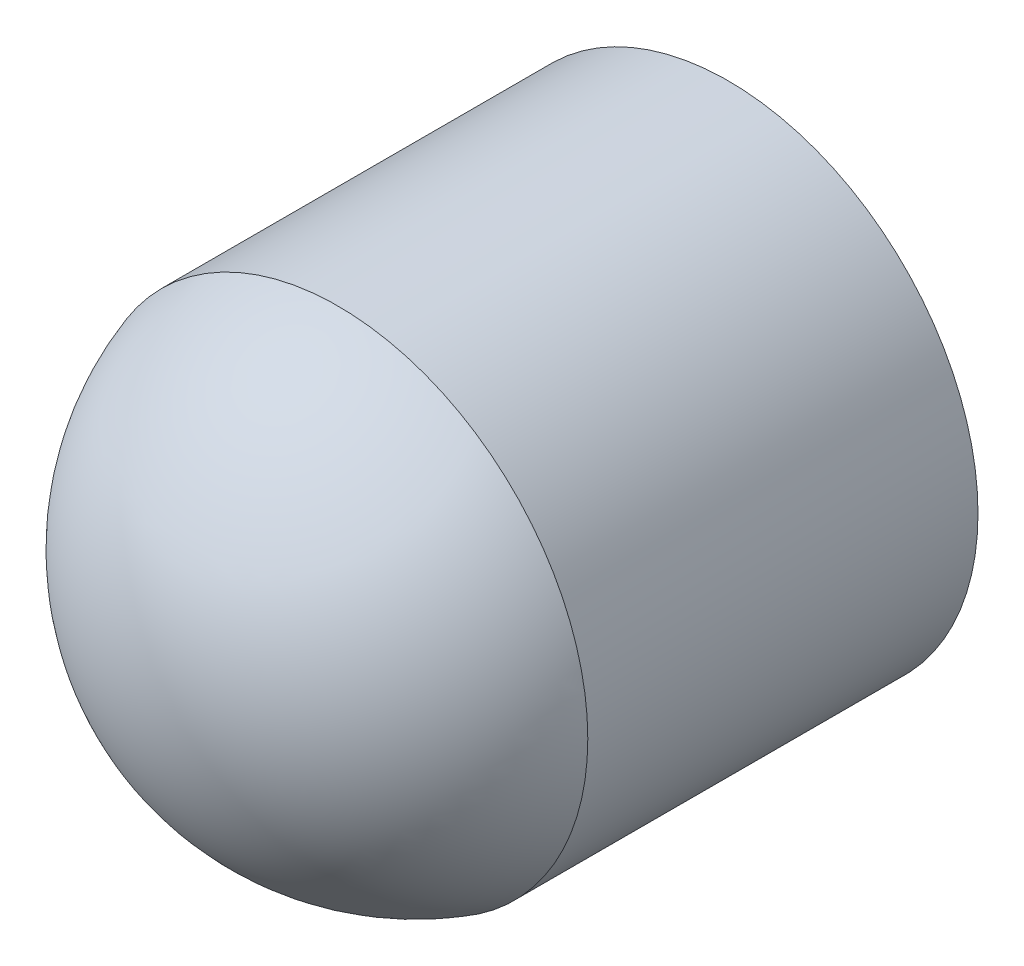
from build123d import *

# Parameters (mm, degrees)
CUT_EXTRUDE1_DEPTH      = 5.565221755
CUT_EXTRUDE1_DEPTH_BACK = 5.565221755
SKETCH13_OUTSIDE_W      = 7.974
SKETCH13_OUTSIDE_H      = 7.974
SKETCH13_OUTSIDE_R      = 2.1


with BuildPart() as part:
    # Sketch12 → Revolve1 (revolve)
    with BuildSketch(Plane(origin=(0, 0, 0), x_dir=(0, 0, -1), z_dir=(1, 0, 0))):
        with BuildLine():
            Line((0, 0), (-1.484, 0))
            ThreePointArc((-1.484, 0), (-1.074977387, -1.2776541), (0, -2.080226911))
            ThreePointArc((0, -2.080226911), (0.353025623, -2.169850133), (0.716, -2.2))
            Line((0.716, -2.2), (3.340845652, -2.2))
            Line((3.340845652, -2.2), (3.340845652, 0))
            Line((3.340845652, 0), (0, 0))
        make_face()
    revolve(axis=Axis((0, 0, 0), (0, 0, -1)))

    # Sketch13 outside → Cut-Extrude1 (cut, two sides: drawn at the far end of the back side and taken through both)
    with BuildSketch(Plane.XY.offset(-CUT_EXTRUDE1_DEPTH_BACK)):
        Rectangle(SKETCH13_OUTSIDE_W, SKETCH13_OUTSIDE_H)
        Circle(SKETCH13_OUTSIDE_R, mode=Mode.SUBTRACT)
    extrude(amount=CUT_EXTRUDE1_DEPTH + CUT_EXTRUDE1_DEPTH_BACK, mode=Mode.SUBTRACT)


solid = part.part
